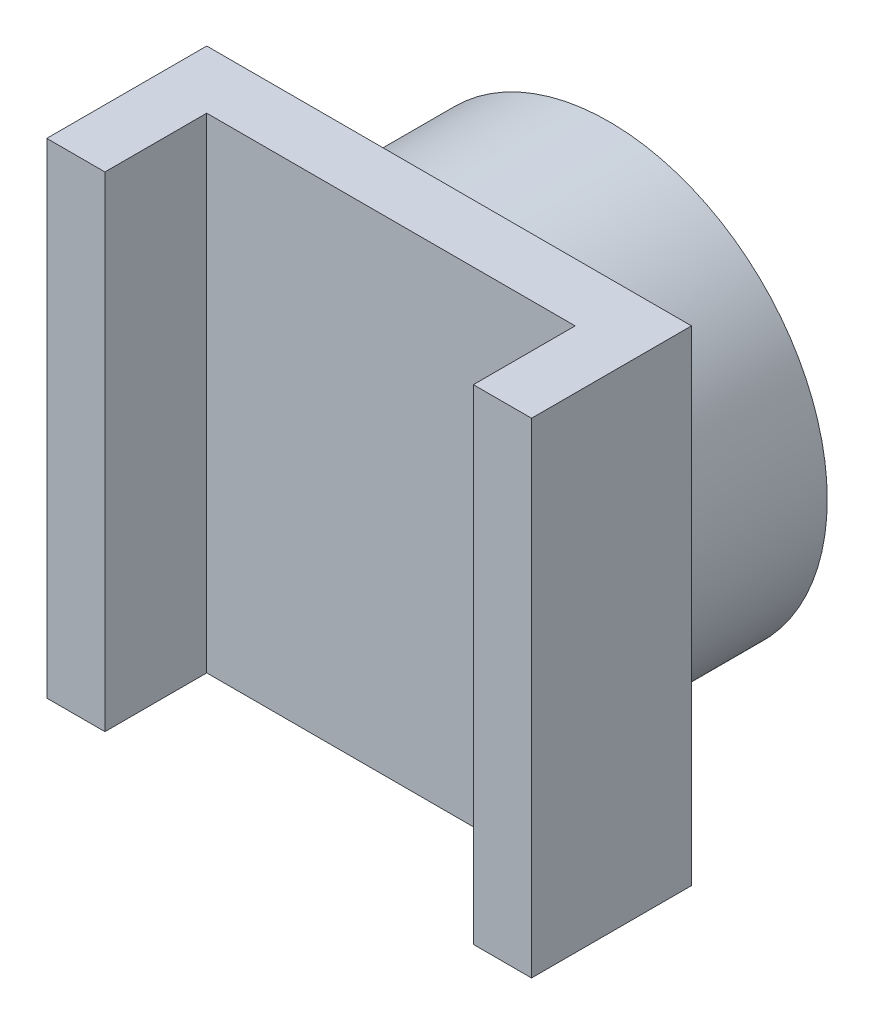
from build123d import *

# Parameters (mm, degrees)
ESQUISSE1_W      = 40
ESQUISSE1_H      = 20
EXTRUSION1_DEPTH = 36
ESQUISSE2_R      = 6.5
EXTRUSION2_DEPTH = 2
ESQUISSE3_R      = 2.8
EXTRUSION3_DEPTH = 3.3
ESQUISSE5_W      = 6.35
ESQUISSE5_H      = 20
ESQUISSE5_R      = 1.55
ESQUISSE5_R_2    = 1.6
EXTRUSION4_DEPTH = 6
EXTRUSION5_START = -3.3
ESQUISSE7_R      = 4.5
ESQUISSE7_R_2    = 2.8
EXTRUSION5_DEPTH = 3.3
EXTRUSION6_DEPTH = 5
EXTRUSION7_DEPTH = 56.529113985
ESQUISSE10_R     = 2.8
EXTRUSION8_DEPTH = 3.3


with BuildPart() as part:
    # Esquisse1 → Extrusion1 (new body)
    with BuildSketch(Plane.XY):
        Rectangle(ESQUISSE1_W, ESQUISSE1_H)
    extrude(amount=EXTRUSION1_DEPTH)

    # Esquisse2 → Extrusion2 (add)
    with BuildSketch(Plane.XY.offset(36)):
        with Locations((10.2, 0)):
            Circle(ESQUISSE2_R)
    extrude(amount=EXTRUSION2_DEPTH)

    # Esquisse3 → Extrusion3 (add)
    with BuildSketch(Plane.XY.offset(38)):
        with Locations((10.2, 0)):
            Circle(ESQUISSE3_R)
    extrude(amount=EXTRUSION3_DEPTH)

    # Esquisse5 → Extrusion4 (add)
    # profile 1 of 2: a face of its own
    with BuildSketch(Plane.XY.offset(32.5)):
        with Locations((23.175, 0)):
            Rectangle(ESQUISSE5_W, ESQUISSE5_H)
        with Locations((23.65, 6.5)):
            Circle(ESQUISSE5_R, mode=Mode.SUBTRACT)
        with Locations((23.65, -6.5)):
            Circle(ESQUISSE5_R, mode=Mode.SUBTRACT)
    # profile 2 of 2: a face of its own
    with BuildSketch(Plane.XY.offset(32.5)):
        with Locations((-23.175, 0)):
            Rectangle(ESQUISSE5_W, ESQUISSE5_H)
        with Locations((-23.85, 6.5)):
            Circle(ESQUISSE5_R_2, mode=Mode.SUBTRACT)
        with Locations((-23.85, -6.5)):
            Circle(ESQUISSE5_R, mode=Mode.SUBTRACT)
    extrude(amount=-EXTRUSION4_DEPTH)

    # Esquisse7 → Extrusion5 (add)
    with BuildSketch(Plane.XY.offset(41.3).offset(EXTRUSION5_START)):
        with Locations((10.2, 0)):
            Circle(ESQUISSE7_R)
        with Locations((10.2, 0)):
            Circle(ESQUISSE7_R_2, mode=Mode.SUBTRACT)
    extrude(amount=EXTRUSION5_DEPTH)

    # Esquisse8 → Extrusion6 (add, symmetric)
    with BuildSketch(Plane(origin=(0, 0, 0), x_dir=(0, 0, -1), z_dir=(0, -1, 0))):
        Polygon((-41.3, 10.2), (-41.3, 15.2), (-44.6, 15.2), (-44.6, 14), (-42.5, 14), (-42.5, 6.4), (-44.6, 6.4), (-44.6, 5.2), (-41.3, 5.2), align=None)
    extrude(amount=EXTRUSION6_DEPTH, both=True)

    # Esquisse9 → Extrusion7 (cut, through all)
    with BuildSketch(Plane(origin=(0, 10, 0), x_dir=(1, 0, 0), z_dir=(0, 1, 0))):
        Polygon((3.7, -38), (16.7, -38), (16.7, -36), (20, -36), (20, -32.5), (26.35, -32.5), (26.35, -26.5), (20, -26.5), (20, 0), (-20, 0), (-20, -26.5), (-26.35, -26.5), (-26.35, -32.5), (-20, -32.5), (-20, -36), (3.7, -36), align=None)
    extrude(amount=-EXTRUSION7_DEPTH, mode=Mode.SUBTRACT)

    # Esquisse10 → Extrusion8 (cut)
    with BuildSketch(Plane(origin=(0, 0, 38), x_dir=(-1, 0, 0), z_dir=(0, 0, -1))):
        with Locations((-10.073307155, 0)):
            Circle(ESQUISSE10_R)
    extrude(amount=-EXTRUSION8_DEPTH, mode=Mode.SUBTRACT)


solid = part.part
